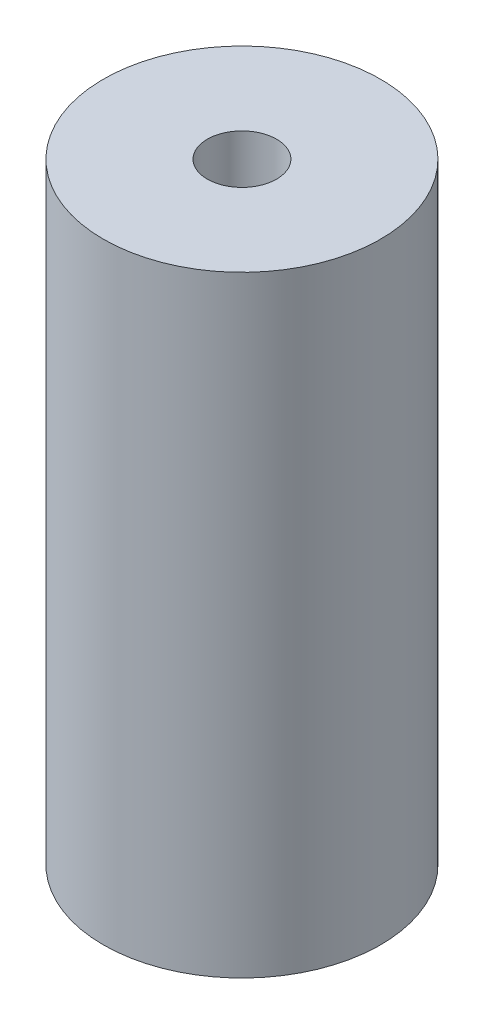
ISO-10303-21;
HEADER;
FILE_DESCRIPTION(('STEP AP214'),'2;1');
FILE_NAME('part.step','',(''),(''),'','','');
FILE_SCHEMA(('AUTOMOTIVE_DESIGN { 1 0 10303 214 1 1 1 1 }'));
ENDSEC;
DATA;
#1=APPLICATION_CONTEXT('core data for automotive mechanical design processes');
#2=APPLICATION_PROTOCOL_DEFINITION('international standard','automotive_design',2000,#1);
#3=PRODUCT_CONTEXT('',#1,'mechanical');
#4=PRODUCT('Part','Part','',(#3));
#5=PRODUCT_RELATED_PRODUCT_CATEGORY('part','',(#4));
#6=PRODUCT_DEFINITION_FORMATION('','',#4);
#7=PRODUCT_DEFINITION_CONTEXT('part definition',#1,'design');
#8=PRODUCT_DEFINITION('design','',#6,#7);
#9=PRODUCT_DEFINITION_SHAPE('','',#8);
#10=(LENGTH_UNIT() NAMED_UNIT(*) SI_UNIT(.MILLI.,.METRE.));
#11=(NAMED_UNIT(*) PLANE_ANGLE_UNIT() SI_UNIT($,.RADIAN.));
#12=(NAMED_UNIT(*) SI_UNIT($,.STERADIAN.) SOLID_ANGLE_UNIT());
#13=UNCERTAINTY_MEASURE_WITH_UNIT(LENGTH_MEASURE(1.E-05),#10,'distance_accuracy_value','');
#14=(GEOMETRIC_REPRESENTATION_CONTEXT(3) GLOBAL_UNCERTAINTY_ASSIGNED_CONTEXT((#13)) GLOBAL_UNIT_ASSIGNED_CONTEXT((#10,
#11,#12)) REPRESENTATION_CONTEXT('',''));
#15=CARTESIAN_POINT('',(0.,0.,0.));
#16=DIRECTION('',(0.,0.,1.));
#17=DIRECTION('',(1.,0.,0.));
#18=AXIS2_PLACEMENT_3D('',#15,#16,#17);
#19=CARTESIAN_POINT('',(0.,14.,0.));
#20=DIRECTION('',(0.,1.,0.));
#21=DIRECTION('',(0.,0.,1.));
#22=AXIS2_PLACEMENT_3D('',#19,#20,#21);
#23=CYLINDRICAL_SURFACE('',#22,1.58749999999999);
#24=CARTESIAN_POINT('',(0.,14.,0.));
#25=DIRECTION('',(0.,1.,0.));
#26=DIRECTION('',(0.,0.,1.));
#27=AXIS2_PLACEMENT_3D('',#24,#25,#26);
#28=CIRCLE('',#27,1.58749999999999);
#29=CARTESIAN_POINT('',(0.,14.,1.58749999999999));
#30=VERTEX_POINT('',#29);
#31=EDGE_CURVE('E53',#30,#30,#28,.T.);
#32=ORIENTED_EDGE('',*,*,#31,.T.);
#33=EDGE_LOOP('',(#32));
#34=FACE_BOUND('',#33,.T.);
#35=CARTESIAN_POINT('',(0.,-11.6,0.));
#36=DIRECTION('',(0.,-1.,0.));
#37=DIRECTION('',(0.,0.,-1.));
#38=AXIS2_PLACEMENT_3D('',#35,#36,#37);
#39=CIRCLE('',#38,1.5875);
#40=CARTESIAN_POINT('',(0.,-11.6,-1.5875));
#41=VERTEX_POINT('',#40);
#42=EDGE_CURVE('E61',#41,#41,#39,.T.);
#43=ORIENTED_EDGE('',*,*,#42,.T.);
#44=EDGE_LOOP('',(#43));
#45=FACE_BOUND('',#44,.T.);
#46=ADVANCED_FACE('F39',(#34,#45),#23,.F.);
#47=CARTESIAN_POINT('',(0.,14.,0.));
#48=DIRECTION('',(0.,-1.,0.));
#49=DIRECTION('',(0.,0.,-1.));
#50=AXIS2_PLACEMENT_3D('',#47,#48,#49);
#51=CYLINDRICAL_SURFACE('',#50,6.35);
#52=CARTESIAN_POINT('',(0.,14.,0.));
#53=DIRECTION('',(0.,1.,0.));
#54=DIRECTION('',(0.,0.,1.));
#55=AXIS2_PLACEMENT_3D('',#52,#53,#54);
#56=CIRCLE('',#55,6.35);
#57=CARTESIAN_POINT('',(0.,14.,6.35));
#58=VERTEX_POINT('',#57);
#59=EDGE_CURVE('E10',#58,#58,#56,.T.);
#60=ORIENTED_EDGE('',*,*,#59,.F.);
#61=EDGE_LOOP('',(#60));
#62=FACE_BOUND('',#61,.T.);
#63=CARTESIAN_POINT('',(0.,-14.,0.));
#64=DIRECTION('',(0.,1.,0.));
#65=DIRECTION('',(0.,0.,1.));
#66=AXIS2_PLACEMENT_3D('',#63,#64,#65);
#67=CIRCLE('',#66,6.35);
#68=CARTESIAN_POINT('',(0.,-14.,6.35));
#69=VERTEX_POINT('',#68);
#70=EDGE_CURVE('E43',#69,#69,#67,.T.);
#71=ORIENTED_EDGE('',*,*,#70,.T.);
#72=EDGE_LOOP('',(#71));
#73=FACE_BOUND('',#72,.T.);
#74=ADVANCED_FACE('F41',(#62,#73),#51,.T.);
#75=CARTESIAN_POINT('',(0.,14.,0.));
#76=DIRECTION('',(0.,1.,0.));
#77=DIRECTION('',(0.,0.,1.));
#78=AXIS2_PLACEMENT_3D('',#75,#76,#77);
#79=PLANE('',#78);
#80=ORIENTED_EDGE('',*,*,#31,.F.);
#81=EDGE_LOOP('',(#80));
#82=FACE_BOUND('',#81,.T.);
#83=ORIENTED_EDGE('',*,*,#59,.T.);
#84=EDGE_LOOP('',(#83));
#85=FACE_BOUND('',#84,.T.);
#86=ADVANCED_FACE('F75',(#82,#85),#79,.T.);
#87=CARTESIAN_POINT('',(0.,-14.,0.));
#88=DIRECTION('',(0.,1.,0.));
#89=DIRECTION('',(0.,0.,1.));
#90=AXIS2_PLACEMENT_3D('',#87,#88,#89);
#91=PLANE('',#90);
#92=CARTESIAN_POINT('',(0.,-14.,0.));
#93=DIRECTION('',(0.,-1.,0.));
#94=DIRECTION('',(0.,0.,-1.));
#95=AXIS2_PLACEMENT_3D('',#92,#93,#94);
#96=CIRCLE('',#95,3.9875);
#97=CARTESIAN_POINT('',(0.,-14.,-3.9875));
#98=VERTEX_POINT('',#97);
#99=EDGE_CURVE('E58',#98,#98,#96,.T.);
#100=ORIENTED_EDGE('',*,*,#99,.F.);
#101=EDGE_LOOP('',(#100));
#102=FACE_BOUND('',#101,.T.);
#103=ORIENTED_EDGE('',*,*,#70,.F.);
#104=EDGE_LOOP('',(#103));
#105=FACE_BOUND('',#104,.T.);
#106=ADVANCED_FACE('F69',(#102,#105),#91,.F.);
#107=CARTESIAN_POINT('',(0.,-11.6,0.));
#108=DIRECTION('',(0.,-1.,0.));
#109=DIRECTION('',(0.,0.,-1.));
#110=AXIS2_PLACEMENT_3D('',#107,#108,#109);
#111=CONICAL_SURFACE('',#110,1.5875,0.785398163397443);
#112=ORIENTED_EDGE('',*,*,#99,.T.);
#113=EDGE_LOOP('',(#112));
#114=FACE_BOUND('',#113,.T.);
#115=ORIENTED_EDGE('',*,*,#42,.F.);
#116=EDGE_LOOP('',(#115));
#117=FACE_BOUND('',#116,.T.);
#118=ADVANCED_FACE('F67',(#114,#117),#111,.F.);
#119=CLOSED_SHELL('',(#46,#74,#86,#106,#118));
#120=MANIFOLD_SOLID_BREP('B2',#119);
#121=ADVANCED_BREP_SHAPE_REPRESENTATION('',(#18,#120),#14);
#122=SHAPE_DEFINITION_REPRESENTATION(#9,#121);
ENDSEC;
END-ISO-10303-21;
